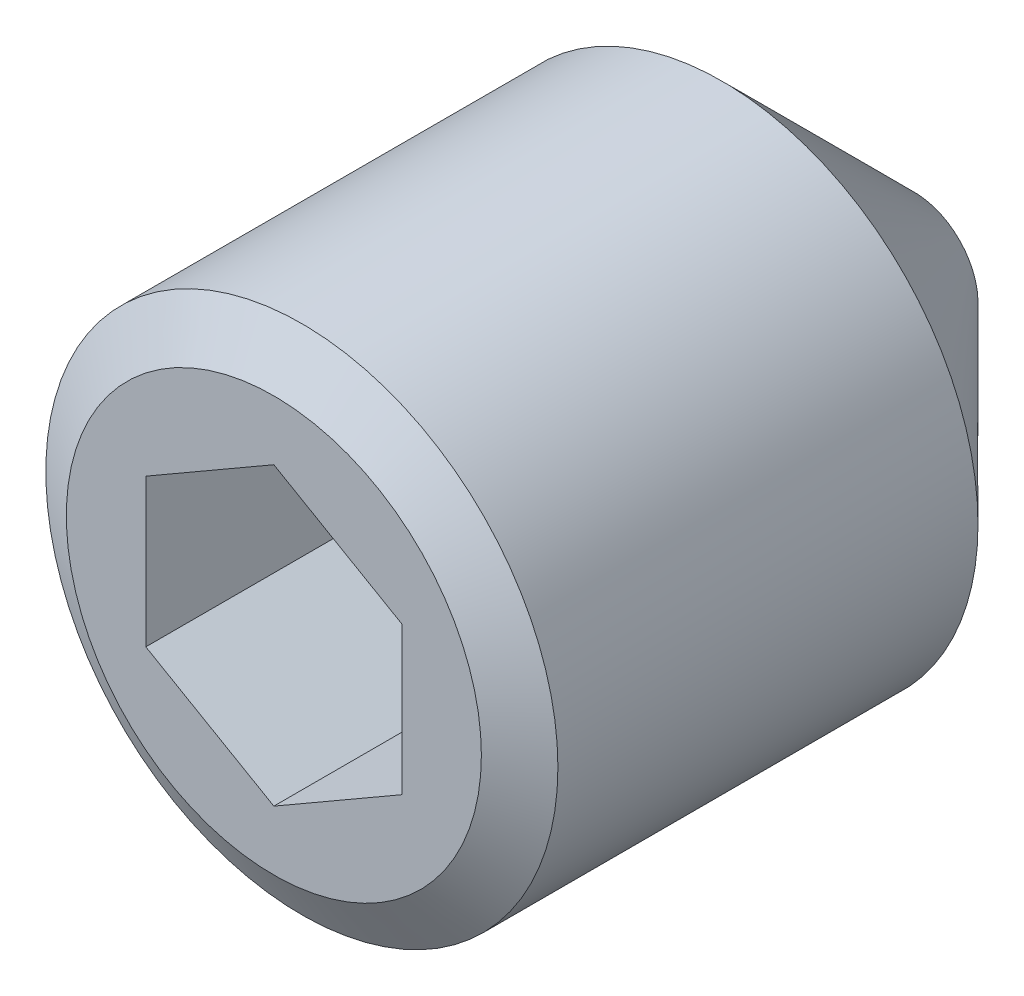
ISO-10303-21;
HEADER;
FILE_DESCRIPTION(('STEP AP214'),'2;1');
FILE_NAME('part.step','',(''),(''),'','','');
FILE_SCHEMA(('AUTOMOTIVE_DESIGN { 1 0 10303 214 1 1 1 1 }'));
ENDSEC;
DATA;
#1=APPLICATION_CONTEXT('core data for automotive mechanical design processes');
#2=APPLICATION_PROTOCOL_DEFINITION('international standard','automotive_design',2000,#1);
#3=PRODUCT_CONTEXT('',#1,'mechanical');
#4=PRODUCT('Part','Part','',(#3));
#5=PRODUCT_RELATED_PRODUCT_CATEGORY('part','',(#4));
#6=PRODUCT_DEFINITION_FORMATION('','',#4);
#7=PRODUCT_DEFINITION_CONTEXT('part definition',#1,'design');
#8=PRODUCT_DEFINITION('design','',#6,#7);
#9=PRODUCT_DEFINITION_SHAPE('','',#8);
#10=(LENGTH_UNIT() NAMED_UNIT(*) SI_UNIT(.MILLI.,.METRE.));
#11=(NAMED_UNIT(*) PLANE_ANGLE_UNIT() SI_UNIT($,.RADIAN.));
#12=(NAMED_UNIT(*) SI_UNIT($,.STERADIAN.) SOLID_ANGLE_UNIT());
#13=UNCERTAINTY_MEASURE_WITH_UNIT(LENGTH_MEASURE(1.E-05),#10,'distance_accuracy_value','');
#14=(GEOMETRIC_REPRESENTATION_CONTEXT(3) GLOBAL_UNCERTAINTY_ASSIGNED_CONTEXT((#13)) GLOBAL_UNIT_ASSIGNED_CONTEXT((#10,
#11,#12)) REPRESENTATION_CONTEXT('',''));
#15=CARTESIAN_POINT('',(0.,0.,0.));
#16=DIRECTION('',(0.,0.,1.));
#17=DIRECTION('',(1.,0.,0.));
#18=AXIS2_PLACEMENT_3D('',#15,#16,#17);
#19=CARTESIAN_POINT('',(0.,0.,0.));
#20=DIRECTION('',(0.,0.,1.));
#21=DIRECTION('',(1.,0.,0.));
#22=AXIS2_PLACEMENT_3D('',#19,#20,#21);
#23=CYLINDRICAL_SURFACE('',#22,2.);
#24=CARTESIAN_POINT('',(0.,0.,1.5));
#25=DIRECTION('',(0.,0.,-1.));
#26=DIRECTION('',(0.,1.,0.));
#27=AXIS2_PLACEMENT_3D('',#24,#25,#26);
#28=CIRCLE('',#27,2.);
#29=CARTESIAN_POINT('',(0.,-2.,1.5));
#30=VERTEX_POINT('',#29);
#31=EDGE_CURVE('E21',#30,#30,#28,.T.);
#32=ORIENTED_EDGE('',*,*,#31,.F.);
#33=EDGE_LOOP('',(#32));
#34=FACE_BOUND('',#33,.T.);
#35=CARTESIAN_POINT('',(0.,0.,4.78118424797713));
#36=DIRECTION('',(0.,0.,1.));
#37=DIRECTION('',(1.,0.,0.));
#38=AXIS2_PLACEMENT_3D('',#35,#36,#37);
#39=CIRCLE('',#38,2.);
#40=CARTESIAN_POINT('',(2.,0.,4.78118424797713));
#41=VERTEX_POINT('',#40);
#42=EDGE_CURVE('E153',#41,#41,#39,.T.);
#43=ORIENTED_EDGE('',*,*,#42,.F.);
#44=EDGE_LOOP('',(#43));
#45=FACE_BOUND('',#44,.T.);
#46=ADVANCED_FACE('F14',(#34,#45),#23,.T.);
#47=CARTESIAN_POINT('',(0.,0.,1.5));
#48=DIRECTION('',(0.,0.,1.));
#49=DIRECTION('',(0.,-1.,0.));
#50=AXIS2_PLACEMENT_3D('',#47,#48,#49);
#51=CONICAL_SURFACE('',#50,2.,0.785398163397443);
#52=CARTESIAN_POINT('',(0.,0.,0.));
#53=DIRECTION('',(0.,0.,-1.));
#54=DIRECTION('',(0.,1.,0.));
#55=AXIS2_PLACEMENT_3D('',#52,#53,#54);
#56=CIRCLE('',#55,0.5);
#57=CARTESIAN_POINT('',(0.,-0.500000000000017,0.));
#58=VERTEX_POINT('',#57);
#59=EDGE_CURVE('E9',#58,#58,#56,.T.);
#60=CARTESIAN_POINT('',(0.,-0.500000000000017,0.));
#61=CARTESIAN_POINT('',(0.,-0.515625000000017,0.015625));
#62=CARTESIAN_POINT('',(0.,-0.531250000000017,0.03125));
#63=CARTESIAN_POINT('',(0.,-0.562500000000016,0.0625000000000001));
#64=CARTESIAN_POINT('',(0.,-0.578125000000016,0.0781250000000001));
#65=CARTESIAN_POINT('',(0.,-0.609375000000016,0.109375));
#66=CARTESIAN_POINT('',(0.,-0.625000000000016,0.125));
#67=CARTESIAN_POINT('',(0.,-0.656250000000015,0.15625));
#68=CARTESIAN_POINT('',(0.,-0.671875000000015,0.171875));
#69=CARTESIAN_POINT('',(0.,-0.703125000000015,0.203125));
#70=CARTESIAN_POINT('',(0.,-0.718750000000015,0.21875));
#71=CARTESIAN_POINT('',(0.,-0.750000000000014,0.25));
#72=CARTESIAN_POINT('',(0.,-0.765625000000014,0.265625));
#73=CARTESIAN_POINT('',(0.,-0.796875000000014,0.296875));
#74=CARTESIAN_POINT('',(0.,-0.812500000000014,0.3125));
#75=CARTESIAN_POINT('',(0.,-0.843750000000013,0.34375));
#76=CARTESIAN_POINT('',(0.,-0.859375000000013,0.359375));
#77=CARTESIAN_POINT('',(0.,-0.890625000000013,0.390625));
#78=CARTESIAN_POINT('',(0.,-0.906250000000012,0.40625));
#79=CARTESIAN_POINT('',(0.,-0.937500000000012,0.4375));
#80=CARTESIAN_POINT('',(0.,-0.953125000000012,0.453125));
#81=CARTESIAN_POINT('',(0.,-0.984375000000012,0.484375));
#82=CARTESIAN_POINT('',(0.,-1.00000000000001,0.5));
#83=CARTESIAN_POINT('',(0.,-1.03125000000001,0.53125));
#84=CARTESIAN_POINT('',(0.,-1.04687500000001,0.546875));
#85=CARTESIAN_POINT('',(0.,-1.07812500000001,0.578125));
#86=CARTESIAN_POINT('',(0.,-1.09375000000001,0.59375));
#87=CARTESIAN_POINT('',(0.,-1.12500000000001,0.625));
#88=CARTESIAN_POINT('',(0.,-1.14062500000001,0.640625));
#89=CARTESIAN_POINT('',(0.,-1.17187500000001,0.671875));
#90=CARTESIAN_POINT('',(0.,-1.18750000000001,0.6875));
#91=CARTESIAN_POINT('',(0.,-1.21875000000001,0.71875));
#92=CARTESIAN_POINT('',(0.,-1.23437500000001,0.734375));
#93=CARTESIAN_POINT('',(0.,-1.26562500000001,0.765625));
#94=CARTESIAN_POINT('',(0.,-1.28125000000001,0.78125));
#95=CARTESIAN_POINT('',(0.,-1.31250000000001,0.8125));
#96=CARTESIAN_POINT('',(0.,-1.32812500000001,0.828125));
#97=CARTESIAN_POINT('',(0.,-1.35937500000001,0.859375));
#98=CARTESIAN_POINT('',(0.,-1.37500000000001,0.875));
#99=CARTESIAN_POINT('',(0.,-1.40625000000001,0.90625));
#100=CARTESIAN_POINT('',(0.,-1.42187500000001,0.921875));
#101=CARTESIAN_POINT('',(0.,-1.45312500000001,0.953125));
#102=CARTESIAN_POINT('',(0.,-1.46875000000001,0.96875));
#103=CARTESIAN_POINT('',(0.,-1.50000000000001,1.));
#104=CARTESIAN_POINT('',(0.,-1.51562500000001,1.015625));
#105=CARTESIAN_POINT('',(0.,-1.54687500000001,1.046875));
#106=CARTESIAN_POINT('',(0.,-1.56250000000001,1.0625));
#107=CARTESIAN_POINT('',(0.,-1.59375,1.09375));
#108=CARTESIAN_POINT('',(0.,-1.609375,1.109375));
#109=CARTESIAN_POINT('',(0.,-1.640625,1.140625));
#110=CARTESIAN_POINT('',(0.,-1.65625,1.15625));
#111=CARTESIAN_POINT('',(0.,-1.6875,1.1875));
#112=CARTESIAN_POINT('',(0.,-1.703125,1.203125));
#113=CARTESIAN_POINT('',(0.,-1.734375,1.234375));
#114=CARTESIAN_POINT('',(0.,-1.75,1.25));
#115=CARTESIAN_POINT('',(0.,-1.78125,1.28125));
#116=CARTESIAN_POINT('',(0.,-1.796875,1.296875));
#117=CARTESIAN_POINT('',(0.,-1.828125,1.328125));
#118=CARTESIAN_POINT('',(0.,-1.84375,1.34375));
#119=CARTESIAN_POINT('',(0.,-1.875,1.375));
#120=CARTESIAN_POINT('',(0.,-1.890625,1.390625));
#121=CARTESIAN_POINT('',(0.,-1.921875,1.421875));
#122=CARTESIAN_POINT('',(0.,-1.9375,1.4375));
#123=CARTESIAN_POINT('',(0.,-1.96875,1.46875));
#124=CARTESIAN_POINT('',(0.,-1.984375,1.484375));
#125=CARTESIAN_POINT('',(0.,-2.,1.5));
#126=B_SPLINE_CURVE_WITH_KNOTS('',3,(#60,#61,#62,#63,#64,#65,#66,#67,#68,#69,#70,#71,#72,#73,
#74,#75,#76,#77,#78,#79,#80,#81,#82,#83,#84,#85,#86,#87,#88,#89,#90,#91,#92,#93,#94,#95,#96,#97,
#98,#99,#100,#101,#102,#103,#104,#105,#106,#107,#108,#109,#110,#111,#112,#113,#114,#115,#116,
#117,#118,#119,#120,#121,#122,#123,#124,#125),.UNSPECIFIED.,.F.,.F.,(4,2,2,2,2,2,2,2,2,2,2,2,2,
2,2,2,2,2,2,2,2,2,2,2,2,2,2,2,2,2,2,2,4),(0.,0.0662912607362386,0.132582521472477,
0.198873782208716,0.265165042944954,0.331456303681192,0.397747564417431,0.464038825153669,
0.530330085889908,0.596621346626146,0.662912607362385,0.729203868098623,0.795495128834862,
0.8617863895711,0.928077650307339,0.994368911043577,1.06066017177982,1.12695143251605,
1.19324269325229,1.25953395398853,1.32582521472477,1.39211647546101,1.45840773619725,
1.52469899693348,1.59099025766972,1.65728151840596,1.7235727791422,1.78986403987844,
1.85615530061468,1.92244656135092,1.98873782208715,2.05502908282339,2.12132034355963),.UNSPECIFIED.);
#127=EDGE_CURVE('BSEAM162',#58,#30,#126,.T.);
#128=ORIENTED_EDGE('',*,*,#59,.F.);
#129=ORIENTED_EDGE('',*,*,#31,.T.);
#130=ORIENTED_EDGE('',*,*,#127,.T.);
#131=ORIENTED_EDGE('',*,*,#127,.F.);
#132=EDGE_LOOP('',(#128,#130,#129,#131));
#133=FACE_BOUND('',#132,.T.);
#134=ADVANCED_FACE('F162',(#133),#51,.T.);
#135=CARTESIAN_POINT('',(0.,0.,0.));
#136=DIRECTION('',(0.,0.,-1.));
#137=DIRECTION('',(-1.,0.,0.));
#138=AXIS2_PLACEMENT_3D('',#135,#136,#137);
#139=PLANE('',#138);
#140=ORIENTED_EDGE('',*,*,#59,.T.);
#141=EDGE_LOOP('',(#140));
#142=FACE_BOUND('',#141,.T.);
#143=ADVANCED_FACE('F172',(#142),#139,.T.);
#144=CARTESIAN_POINT('',(0.,0.,5.));
#145=DIRECTION('',(0.,0.,-1.));
#146=DIRECTION('',(-1.,0.,0.));
#147=AXIS2_PLACEMENT_3D('',#144,#145,#146);
#148=CONICAL_SURFACE('',#147,1.621,1.0471975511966);
#149=ORIENTED_EDGE('',*,*,#42,.T.);
#150=EDGE_LOOP('',(#149));
#151=FACE_BOUND('',#150,.T.);
#152=CARTESIAN_POINT('',(0.,0.,5.));
#153=DIRECTION('',(0.,0.,1.));
#154=DIRECTION('',(1.,0.,0.));
#155=AXIS2_PLACEMENT_3D('',#152,#153,#154);
#156=CIRCLE('',#155,1.621);
#157=CARTESIAN_POINT('',(1.621,0.,5.));
#158=VERTEX_POINT('',#157);
#159=EDGE_CURVE('E157',#158,#158,#156,.T.);
#160=ORIENTED_EDGE('',*,*,#159,.F.);
#161=EDGE_LOOP('',(#160));
#162=FACE_BOUND('',#161,.T.);
#163=ADVANCED_FACE('F168',(#151,#162),#148,.T.);
#164=CARTESIAN_POINT('',(0.,0.,5.));
#165=DIRECTION('',(0.,0.,-1.));
#166=DIRECTION('',(-1.,0.,0.));
#167=AXIS2_PLACEMENT_3D('',#164,#165,#166);
#168=PLANE('',#167);
#169=DIRECTION('',(-0.866025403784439,0.5,0.));
#170=VECTOR('',#169,1.);
#171=CARTESIAN_POINT('',(1.,0.577350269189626,5.));
#172=LINE('',#171,#170);
#173=CARTESIAN_POINT('',(1.,0.577350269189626,5.));
#174=VERTEX_POINT('',#173);
#175=CARTESIAN_POINT('',(0.,1.15470053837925,5.));
#176=VERTEX_POINT('',#175);
#177=EDGE_CURVE('E126',#174,#176,#172,.T.);
#178=ORIENTED_EDGE('',*,*,#177,.F.);
#179=DIRECTION('',(0.,1.,0.));
#180=VECTOR('',#179,1.);
#181=CARTESIAN_POINT('',(1.,-0.577350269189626,5.));
#182=LINE('',#181,#180);
#183=CARTESIAN_POINT('',(1.,-0.577350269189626,5.));
#184=VERTEX_POINT('',#183);
#185=EDGE_CURVE('E28',#184,#174,#182,.T.);
#186=ORIENTED_EDGE('',*,*,#185,.F.);
#187=DIRECTION('',(0.866025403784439,0.5,0.));
#188=VECTOR('',#187,1.);
#189=CARTESIAN_POINT('',(0.,-1.15470053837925,5.));
#190=LINE('',#189,#188);
#191=CARTESIAN_POINT('',(0.,-1.15470053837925,5.));
#192=VERTEX_POINT('',#191);
#193=EDGE_CURVE('E94',#192,#184,#190,.T.);
#194=ORIENTED_EDGE('',*,*,#193,.F.);
#195=DIRECTION('',(0.866025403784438,-0.5,0.));
#196=VECTOR('',#195,1.);
#197=CARTESIAN_POINT('',(-1.,-0.577350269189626,5.));
#198=LINE('',#197,#196);
#199=CARTESIAN_POINT('',(-1.,-0.577350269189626,5.));
#200=VERTEX_POINT('',#199);
#201=EDGE_CURVE('E134',#200,#192,#198,.T.);
#202=ORIENTED_EDGE('',*,*,#201,.F.);
#203=DIRECTION('',(0.,-1.,0.));
#204=VECTOR('',#203,1.);
#205=CARTESIAN_POINT('',(-1.,0.577350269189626,5.));
#206=LINE('',#205,#204);
#207=CARTESIAN_POINT('',(-1.,0.577350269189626,5.));
#208=VERTEX_POINT('',#207);
#209=EDGE_CURVE('E131',#208,#200,#206,.T.);
#210=ORIENTED_EDGE('',*,*,#209,.F.);
#211=DIRECTION('',(-0.866025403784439,-0.5,0.));
#212=VECTOR('',#211,1.);
#213=CARTESIAN_POINT('',(0.,1.15470053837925,5.));
#214=LINE('',#213,#212);
#215=EDGE_CURVE('E128',#176,#208,#214,.T.);
#216=ORIENTED_EDGE('',*,*,#215,.F.);
#217=EDGE_LOOP('',(#178,#186,#194,#202,#210,#216));
#218=FACE_BOUND('',#217,.T.);
#219=ORIENTED_EDGE('',*,*,#159,.T.);
#220=EDGE_LOOP('',(#219));
#221=FACE_BOUND('',#220,.T.);
#222=ADVANCED_FACE('F171',(#218,#221),#168,.F.);
#223=CARTESIAN_POINT('',(1.,-0.577350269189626,3.5));
#224=DIRECTION('',(1.,0.,0.));
#225=DIRECTION('',(0.,0.,-1.));
#226=AXIS2_PLACEMENT_3D('',#223,#224,#225);
#227=PLANE('',#226);
#228=ORIENTED_EDGE('',*,*,#185,.T.);
#229=DIRECTION('',(0.,0.,1.));
#230=VECTOR('',#229,1.);
#231=CARTESIAN_POINT('',(1.,0.577350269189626,3.5));
#232=LINE('',#231,#230);
#233=CARTESIAN_POINT('',(1.,0.577350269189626,3.5));
#234=VERTEX_POINT('',#233);
#235=EDGE_CURVE('E97',#234,#174,#232,.T.);
#236=ORIENTED_EDGE('',*,*,#235,.F.);
#237=DIRECTION('',(0.,1.,0.));
#238=VECTOR('',#237,1.);
#239=CARTESIAN_POINT('',(1.,-0.577350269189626,3.5));
#240=LINE('',#239,#238);
#241=CARTESIAN_POINT('',(1.,0.,3.5));
#242=VERTEX_POINT('',#241);
#243=EDGE_CURVE('E87',#242,#234,#240,.T.);
#244=ORIENTED_EDGE('',*,*,#243,.F.);
#245=CARTESIAN_POINT('',(1.,-0.577350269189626,3.5));
#246=VERTEX_POINT('',#245);
#247=EDGE_CURVE('E93',#246,#242,#240,.T.);
#248=ORIENTED_EDGE('',*,*,#247,.F.);
#249=DIRECTION('',(0.,0.,1.));
#250=VECTOR('',#249,1.);
#251=CARTESIAN_POINT('',(1.,-0.577350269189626,3.5));
#252=LINE('',#251,#250);
#253=EDGE_CURVE('E138',#246,#184,#252,.T.);
#254=ORIENTED_EDGE('',*,*,#253,.T.);
#255=EDGE_LOOP('',(#228,#236,#244,#248,#254));
#256=FACE_BOUND('',#255,.T.);
#257=ADVANCED_FACE('F98',(#256),#227,.F.);
#258=CARTESIAN_POINT('',(0.,-1.15470053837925,3.5));
#259=DIRECTION('',(0.5,-0.866025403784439,0.));
#260=DIRECTION('',(-0.866025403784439,-0.5,0.));
#261=AXIS2_PLACEMENT_3D('',#258,#259,#260);
#262=PLANE('',#261);
#263=ORIENTED_EDGE('',*,*,#193,.T.);
#264=ORIENTED_EDGE('',*,*,#253,.F.);
#265=DIRECTION('',(0.866025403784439,0.5,0.));
#266=VECTOR('',#265,1.);
#267=CARTESIAN_POINT('',(0.,-1.15470053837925,3.5));
#268=LINE('',#267,#266);
#269=CARTESIAN_POINT('',(0.5,-0.866025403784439,3.5));
#270=VERTEX_POINT('',#269);
#271=EDGE_CURVE('E122',#270,#246,#268,.T.);
#272=ORIENTED_EDGE('',*,*,#271,.F.);
#273=CARTESIAN_POINT('',(0.,-1.15470053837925,3.5));
#274=VERTEX_POINT('',#273);
#275=EDGE_CURVE('E102',#274,#270,#268,.T.);
#276=ORIENTED_EDGE('',*,*,#275,.F.);
#277=DIRECTION('',(0.,0.,1.));
#278=VECTOR('',#277,1.);
#279=CARTESIAN_POINT('',(0.,-1.15470053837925,3.5));
#280=LINE('',#279,#278);
#281=EDGE_CURVE('E141',#274,#192,#280,.T.);
#282=ORIENTED_EDGE('',*,*,#281,.T.);
#283=EDGE_LOOP('',(#263,#264,#272,#276,#282));
#284=FACE_BOUND('',#283,.T.);
#285=ADVANCED_FACE('F183',(#284),#262,.F.);
#286=CARTESIAN_POINT('',(-1.,-0.577350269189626,3.5));
#287=DIRECTION('',(-0.5,-0.866025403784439,0.));
#288=DIRECTION('',(-0.866025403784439,0.5,0.));
#289=AXIS2_PLACEMENT_3D('',#286,#287,#288);
#290=PLANE('',#289);
#291=ORIENTED_EDGE('',*,*,#201,.T.);
#292=ORIENTED_EDGE('',*,*,#281,.F.);
#293=DIRECTION('',(0.866025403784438,-0.5,0.));
#294=VECTOR('',#293,1.);
#295=CARTESIAN_POINT('',(-1.,-0.577350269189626,3.5));
#296=LINE('',#295,#294);
#297=CARTESIAN_POINT('',(-0.5,-0.866025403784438,3.5));
#298=VERTEX_POINT('',#297);
#299=EDGE_CURVE('E118',#298,#274,#296,.T.);
#300=ORIENTED_EDGE('',*,*,#299,.F.);
#301=CARTESIAN_POINT('',(-1.,-0.577350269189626,3.5));
#302=VERTEX_POINT('',#301);
#303=EDGE_CURVE('E119',#302,#298,#296,.T.);
#304=ORIENTED_EDGE('',*,*,#303,.F.);
#305=DIRECTION('',(0.,0.,1.));
#306=VECTOR('',#305,1.);
#307=CARTESIAN_POINT('',(-1.,-0.577350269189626,3.5));
#308=LINE('',#307,#306);
#309=EDGE_CURVE('E144',#302,#200,#308,.T.);
#310=ORIENTED_EDGE('',*,*,#309,.T.);
#311=EDGE_LOOP('',(#291,#292,#300,#304,#310));
#312=FACE_BOUND('',#311,.T.);
#313=ADVANCED_FACE('F206',(#312),#290,.F.);
#314=CARTESIAN_POINT('',(-1.,0.577350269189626,3.5));
#315=DIRECTION('',(-1.,0.,0.));
#316=DIRECTION('',(0.,0.,1.));
#317=AXIS2_PLACEMENT_3D('',#314,#315,#316);
#318=PLANE('',#317);
#319=ORIENTED_EDGE('',*,*,#209,.T.);
#320=ORIENTED_EDGE('',*,*,#309,.F.);
#321=DIRECTION('',(0.,-1.,0.));
#322=VECTOR('',#321,1.);
#323=CARTESIAN_POINT('',(-1.,0.577350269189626,3.5));
#324=LINE('',#323,#322);
#325=CARTESIAN_POINT('',(-1.,0.,3.5));
#326=VERTEX_POINT('',#325);
#327=EDGE_CURVE('E114',#326,#302,#324,.T.);
#328=ORIENTED_EDGE('',*,*,#327,.F.);
#329=CARTESIAN_POINT('',(-1.,0.577350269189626,3.5));
#330=VERTEX_POINT('',#329);
#331=EDGE_CURVE('E115',#330,#326,#324,.T.);
#332=ORIENTED_EDGE('',*,*,#331,.F.);
#333=DIRECTION('',(0.,0.,1.));
#334=VECTOR('',#333,1.);
#335=CARTESIAN_POINT('',(-1.,0.577350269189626,3.5));
#336=LINE('',#335,#334);
#337=EDGE_CURVE('E147',#330,#208,#336,.T.);
#338=ORIENTED_EDGE('',*,*,#337,.T.);
#339=EDGE_LOOP('',(#319,#320,#328,#332,#338));
#340=FACE_BOUND('',#339,.T.);
#341=ADVANCED_FACE('F202',(#340),#318,.F.);
#342=CARTESIAN_POINT('',(0.,1.15470053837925,3.5));
#343=DIRECTION('',(-0.5,0.866025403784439,0.));
#344=DIRECTION('',(0.866025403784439,0.5,0.));
#345=AXIS2_PLACEMENT_3D('',#342,#343,#344);
#346=PLANE('',#345);
#347=ORIENTED_EDGE('',*,*,#215,.T.);
#348=ORIENTED_EDGE('',*,*,#337,.F.);
#349=DIRECTION('',(-0.866025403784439,-0.5,0.));
#350=VECTOR('',#349,1.);
#351=CARTESIAN_POINT('',(0.,1.15470053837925,3.5));
#352=LINE('',#351,#350);
#353=CARTESIAN_POINT('',(-0.5,0.866025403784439,3.5));
#354=VERTEX_POINT('',#353);
#355=EDGE_CURVE('E108',#354,#330,#352,.T.);
#356=ORIENTED_EDGE('',*,*,#355,.F.);
#357=CARTESIAN_POINT('',(0.,1.15470053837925,3.5));
#358=VERTEX_POINT('',#357);
#359=EDGE_CURVE('E110',#358,#354,#352,.T.);
#360=ORIENTED_EDGE('',*,*,#359,.F.);
#361=DIRECTION('',(0.,0.,1.));
#362=VECTOR('',#361,1.);
#363=CARTESIAN_POINT('',(0.,1.15470053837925,3.5));
#364=LINE('',#363,#362);
#365=EDGE_CURVE('E101',#358,#176,#364,.T.);
#366=ORIENTED_EDGE('',*,*,#365,.T.);
#367=EDGE_LOOP('',(#347,#348,#356,#360,#366));
#368=FACE_BOUND('',#367,.T.);
#369=ADVANCED_FACE('F199',(#368),#346,.F.);
#370=CARTESIAN_POINT('',(1.,0.577350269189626,3.5));
#371=DIRECTION('',(0.5,0.866025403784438,0.));
#372=DIRECTION('',(0.866025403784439,-0.5,0.));
#373=AXIS2_PLACEMENT_3D('',#370,#371,#372);
#374=PLANE('',#373);
#375=ORIENTED_EDGE('',*,*,#177,.T.);
#376=ORIENTED_EDGE('',*,*,#365,.F.);
#377=DIRECTION('',(-0.866025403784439,0.5,0.));
#378=VECTOR('',#377,1.);
#379=CARTESIAN_POINT('',(1.,0.577350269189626,3.5));
#380=LINE('',#379,#378);
#381=CARTESIAN_POINT('',(0.5,0.866025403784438,3.5));
#382=VERTEX_POINT('',#381);
#383=EDGE_CURVE('E106',#382,#358,#380,.T.);
#384=ORIENTED_EDGE('',*,*,#383,.F.);
#385=EDGE_CURVE('E36',#234,#382,#380,.T.);
#386=ORIENTED_EDGE('',*,*,#385,.F.);
#387=ORIENTED_EDGE('',*,*,#235,.T.);
#388=EDGE_LOOP('',(#375,#376,#384,#386,#387));
#389=FACE_BOUND('',#388,.T.);
#390=ADVANCED_FACE('F104',(#389),#374,.F.);
#391=CARTESIAN_POINT('',(0.,0.,3.5));
#392=DIRECTION('',(0.,0.,1.));
#393=DIRECTION('',(1.,0.,0.));
#394=AXIS2_PLACEMENT_3D('',#391,#392,#393);
#395=PLANE('',#394);
#396=CARTESIAN_POINT('',(0.,0.,3.5));
#397=DIRECTION('',(0.,0.,1.));
#398=DIRECTION('',(1.,0.,0.));
#399=AXIS2_PLACEMENT_3D('',#396,#397,#398);
#400=CIRCLE('',#399,1.);
#401=EDGE_CURVE('E140',#270,#242,#400,.T.);
#402=ORIENTED_EDGE('',*,*,#401,.F.);
#403=ORIENTED_EDGE('',*,*,#271,.T.);
#404=ORIENTED_EDGE('',*,*,#247,.T.);
#405=EDGE_LOOP('',(#402,#403,#404));
#406=FACE_BOUND('',#405,.T.);
#407=ADVANCED_FACE('F198',(#406),#395,.T.);
#408=EDGE_CURVE('E244',#298,#270,#400,.T.);
#409=ORIENTED_EDGE('',*,*,#408,.F.);
#410=ORIENTED_EDGE('',*,*,#299,.T.);
#411=ORIENTED_EDGE('',*,*,#275,.T.);
#412=EDGE_LOOP('',(#409,#410,#411));
#413=FACE_BOUND('',#412,.T.);
#414=ADVANCED_FACE('F215',(#413),#395,.T.);
#415=EDGE_CURVE('E246',#326,#298,#400,.T.);
#416=ORIENTED_EDGE('',*,*,#415,.F.);
#417=ORIENTED_EDGE('',*,*,#327,.T.);
#418=ORIENTED_EDGE('',*,*,#303,.T.);
#419=EDGE_LOOP('',(#416,#417,#418));
#420=FACE_BOUND('',#419,.T.);
#421=ADVANCED_FACE('F221',(#420),#395,.T.);
#422=EDGE_CURVE('E240',#354,#326,#400,.T.);
#423=ORIENTED_EDGE('',*,*,#422,.F.);
#424=ORIENTED_EDGE('',*,*,#355,.T.);
#425=ORIENTED_EDGE('',*,*,#331,.T.);
#426=EDGE_LOOP('',(#423,#424,#425));
#427=FACE_BOUND('',#426,.T.);
#428=ADVANCED_FACE('F229',(#427),#395,.T.);
#429=EDGE_CURVE('E154',#382,#354,#400,.T.);
#430=ORIENTED_EDGE('',*,*,#429,.F.);
#431=ORIENTED_EDGE('',*,*,#383,.T.);
#432=ORIENTED_EDGE('',*,*,#359,.T.);
#433=EDGE_LOOP('',(#430,#431,#432));
#434=FACE_BOUND('',#433,.T.);
#435=ADVANCED_FACE('F224',(#434),#395,.T.);
#436=EDGE_CURVE('E90',#242,#382,#400,.T.);
#437=ORIENTED_EDGE('',*,*,#436,.F.);
#438=ORIENTED_EDGE('',*,*,#243,.T.);
#439=ORIENTED_EDGE('',*,*,#385,.T.);
#440=EDGE_LOOP('',(#437,#438,#439));
#441=FACE_BOUND('',#440,.T.);
#442=ADVANCED_FACE('F88',(#441),#395,.T.);
#443=CARTESIAN_POINT('',(0.,0.,3.5));
#444=DIRECTION('',(0.,0.,1.));
#445=DIRECTION('',(1.,0.,0.));
#446=AXIS2_PLACEMENT_3D('',#443,#444,#445);
#447=CONICAL_SURFACE('',#446,1.,1.02974425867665);
#448=CARTESIAN_POINT('',(0.,0.,2.89913938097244));
#449=VERTEX_POINT('',#448);
#450=VERTEX_LOOP('',#449);
#451=FACE_BOUND('',#450,.T.);
#452=ORIENTED_EDGE('',*,*,#436,.T.);
#453=ORIENTED_EDGE('',*,*,#429,.T.);
#454=ORIENTED_EDGE('',*,*,#422,.T.);
#455=ORIENTED_EDGE('',*,*,#415,.T.);
#456=ORIENTED_EDGE('',*,*,#408,.T.);
#457=ORIENTED_EDGE('',*,*,#401,.T.);
#458=EDGE_LOOP('',(#452,#453,#454,#455,#456,#457));
#459=FACE_BOUND('',#458,.T.);
#460=ADVANCED_FACE('F192',(#451,#459),#447,.F.);
#461=CLOSED_SHELL('',(#46,#134,#143,#163,#222,#257,#285,#313,#341,#369,#390,#407,#414,#421,#428,
#435,#442,#460));
#462=MANIFOLD_SOLID_BREP('B1',#461);
#463=ADVANCED_BREP_SHAPE_REPRESENTATION('',(#18,#462),#14);
#464=SHAPE_DEFINITION_REPRESENTATION(#9,#463);
ENDSEC;
END-ISO-10303-21;
